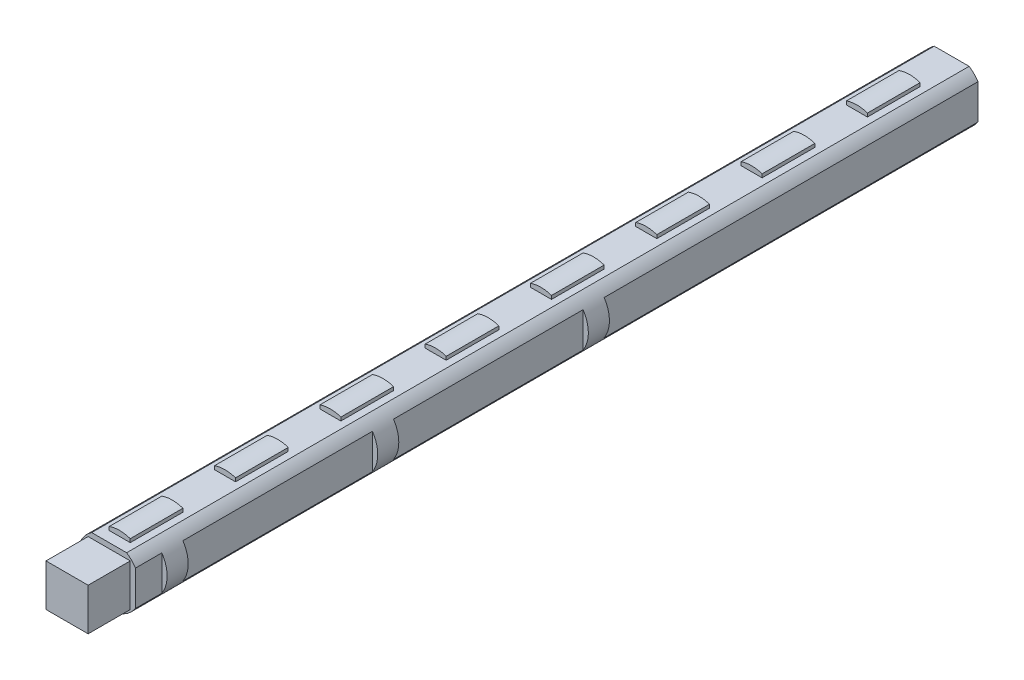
from build123d import *

# Parameters (mm, degrees)
SKETCH1_R          = 19.05
EXTRUDE1_DEPTH     = 508
SKETCH2_W          = 38.1
SKETCH2_H          = 508
SKETCH2_W_2        = 12.7
SKETCH2_H_2        = 31.75
CUT_EXTRUDE1_DEPTH = 3.175
SKETCH3_W          = 508
SKETCH3_H          = 38.1
SKETCH3_W_2        = 12.7
SKETCH3_H_2        = 31.75
CUT_EXTRUDE2_DEPTH = 3.175
SKETCH6_R          = 6.35
CUT_EXTRUDE3_DEPTH = 50.8
SKETCH7_W          = 25.4
SKETCH7_H          = 25.4
EXTRUDE2_DEPTH     = 25.4


with BuildPart() as part:
    # Sketch1 → Extrude1 (new body)
    with BuildSketch(Plane.XY):
        with Locations((-19.05, -19.05)):
            Circle(SKETCH1_R)
    extrude(amount=EXTRUDE1_DEPTH)

    # Sketch2 → Cut-Extrude1 (cut)
    with BuildSketch(Plane(origin=(0, 0, 0), x_dir=(1, 0, 0), z_dir=(0, 1, 0))):
        with Locations((-19.05, -254)):
            Rectangle(SKETCH2_W, SKETCH2_H)
        with Locations((-19.05, -41.275)):
            Rectangle(SKETCH2_W_2, SKETCH2_H_2, mode=Mode.SUBTRACT)
        with Locations((-19.05, -104.775)):
            Rectangle(SKETCH2_W_2, SKETCH2_H_2, mode=Mode.SUBTRACT)
        with Locations((-19.05, -168.275)):
            Rectangle(SKETCH2_W_2, SKETCH2_H_2, mode=Mode.SUBTRACT)
        with Locations((-19.05, -231.775)):
            Rectangle(SKETCH2_W_2, SKETCH2_H_2, mode=Mode.SUBTRACT)
        with Locations((-19.05, -295.275)):
            Rectangle(SKETCH2_W_2, SKETCH2_H_2, mode=Mode.SUBTRACT)
        with Locations((-19.05, -358.775)):
            Rectangle(SKETCH2_W_2, SKETCH2_H_2, mode=Mode.SUBTRACT)
        with Locations((-19.05, -422.275)):
            Rectangle(SKETCH2_W_2, SKETCH2_H_2, mode=Mode.SUBTRACT)
        with Locations((-19.05, -485.775)):
            Rectangle(SKETCH2_W_2, SKETCH2_H_2, mode=Mode.SUBTRACT)
    extrude(amount=-CUT_EXTRUDE1_DEPTH, mode=Mode.SUBTRACT)

    # Sketch3 → Cut-Extrude2 (cut)
    with BuildSketch(Plane(origin=(0, 0, 0), x_dir=(0, 0, -1), z_dir=(1, 0, 0))):
        with Locations((-254, -19.05)):
            Rectangle(SKETCH3_W, SKETCH3_H)
        with Locations((-231.775, -19.05)):
            Rectangle(SKETCH3_W_2, SKETCH3_H_2, mode=Mode.SUBTRACT)
        with Locations((-358.775, -19.05)):
            Rectangle(SKETCH3_W_2, SKETCH3_H_2, mode=Mode.SUBTRACT)
        with Locations((-485.775, -19.05)):
            Rectangle(SKETCH3_W_2, SKETCH3_H_2, mode=Mode.SUBTRACT)
    extrude(amount=-CUT_EXTRUDE2_DEPTH, mode=Mode.SUBTRACT)

    # Sketch6 → Cut-Extrude3 (cut)
    with BuildSketch(Plane(origin=(0, 0, 0), x_dir=(-1, 0, 0), z_dir=(0, 0, -1))):
        with Locations((19.05, -19.05)):
            Circle(SKETCH6_R)
    extrude(amount=-CUT_EXTRUDE3_DEPTH, mode=Mode.SUBTRACT)

    # Sketch7 → Extrude2 (add)
    with BuildSketch(Plane.XY.offset(508)):
        with Locations((-19.05, -19.05)):
            Rectangle(SKETCH7_W, SKETCH7_H)
    extrude(amount=EXTRUDE2_DEPTH)


solid = part.part
